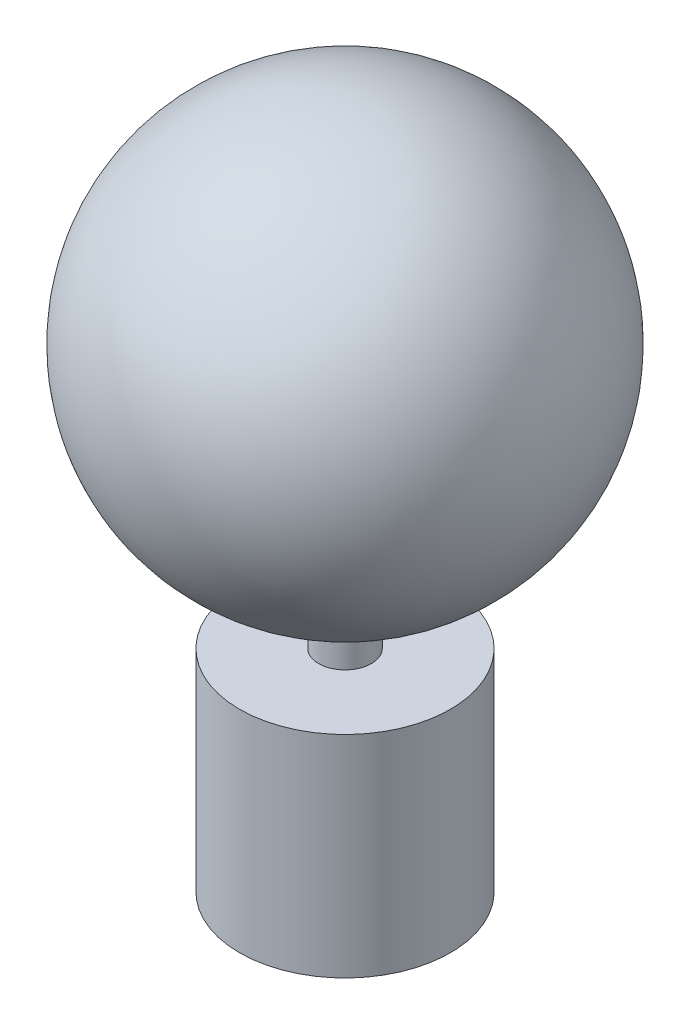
ISO-10303-21;
HEADER;
FILE_DESCRIPTION(('STEP AP214'),'2;1');
FILE_NAME('part.step','',(''),(''),'','','');
FILE_SCHEMA(('AUTOMOTIVE_DESIGN { 1 0 10303 214 1 1 1 1 }'));
ENDSEC;
DATA;
#1=APPLICATION_CONTEXT('core data for automotive mechanical design processes');
#2=APPLICATION_PROTOCOL_DEFINITION('international standard','automotive_design',2000,#1);
#3=PRODUCT_CONTEXT('',#1,'mechanical');
#4=PRODUCT('Part','Part','',(#3));
#5=PRODUCT_RELATED_PRODUCT_CATEGORY('part','',(#4));
#6=PRODUCT_DEFINITION_FORMATION('','',#4);
#7=PRODUCT_DEFINITION_CONTEXT('part definition',#1,'design');
#8=PRODUCT_DEFINITION('design','',#6,#7);
#9=PRODUCT_DEFINITION_SHAPE('','',#8);
#10=(LENGTH_UNIT() NAMED_UNIT(*) SI_UNIT(.MILLI.,.METRE.));
#11=(NAMED_UNIT(*) PLANE_ANGLE_UNIT() SI_UNIT($,.RADIAN.));
#12=(NAMED_UNIT(*) SI_UNIT($,.STERADIAN.) SOLID_ANGLE_UNIT());
#13=UNCERTAINTY_MEASURE_WITH_UNIT(LENGTH_MEASURE(1.E-05),#10,'distance_accuracy_value','');
#14=(GEOMETRIC_REPRESENTATION_CONTEXT(3) GLOBAL_UNCERTAINTY_ASSIGNED_CONTEXT((#13)) GLOBAL_UNIT_ASSIGNED_CONTEXT((#10,
#11,#12)) REPRESENTATION_CONTEXT('',''));
#15=CARTESIAN_POINT('',(0.,0.,0.));
#16=DIRECTION('',(0.,0.,1.));
#17=DIRECTION('',(1.,0.,0.));
#18=AXIS2_PLACEMENT_3D('',#15,#16,#17);
#19=CARTESIAN_POINT('',(0.,31.75,0.));
#20=DIRECTION('',(0.,0.,-1.));
#21=DIRECTION('',(1.,0.,0.));
#22=AXIS2_PLACEMENT_3D('',#19,#20,#21);
#23=SPHERICAL_SURFACE('',#22,25.4);
#24=CARTESIAN_POINT('',(0.,31.75,-25.4));
#25=VERTEX_POINT('',#24);
#26=VERTEX_LOOP('',#25);
#27=FACE_BOUND('',#26,.T.);
#28=ADVANCED_FACE('F39',(#27),#23,.T.);
#29=CLOSED_SHELL('',(#28));
#30=MANIFOLD_SOLID_BREP('B2',#29);
#31=CARTESIAN_POINT('',(0.,-25.4,0.));
#32=DIRECTION('',(0.,1.,0.));
#33=DIRECTION('',(0.,0.,1.));
#34=AXIS2_PLACEMENT_3D('',#31,#32,#33);
#35=CYLINDRICAL_SURFACE('',#34,12.7);
#36=CARTESIAN_POINT('',(0.,-25.4,0.));
#37=DIRECTION('',(0.,1.,0.));
#38=DIRECTION('',(0.,0.,1.));
#39=AXIS2_PLACEMENT_3D('',#36,#37,#38);
#40=CIRCLE('',#39,12.7);
#41=CARTESIAN_POINT('',(0.,-25.4,12.7));
#42=VERTEX_POINT('',#41);
#43=EDGE_CURVE('E37',#42,#42,#40,.T.);
#44=ORIENTED_EDGE('',*,*,#43,.T.);
#45=EDGE_LOOP('',(#44));
#46=FACE_BOUND('',#45,.T.);
#47=CARTESIAN_POINT('',(0.,0.,0.));
#48=DIRECTION('',(0.,1.,0.));
#49=DIRECTION('',(0.,0.,1.));
#50=AXIS2_PLACEMENT_3D('',#47,#48,#49);
#51=CIRCLE('',#50,12.7);
#52=CARTESIAN_POINT('',(0.,0.,12.7));
#53=VERTEX_POINT('',#52);
#54=EDGE_CURVE('E55',#53,#53,#51,.T.);
#55=ORIENTED_EDGE('',*,*,#54,.F.);
#56=EDGE_LOOP('',(#55));
#57=FACE_BOUND('',#56,.T.);
#58=ADVANCED_FACE('F52',(#46,#57),#35,.T.);
#59=CARTESIAN_POINT('',(0.,-25.4,0.));
#60=DIRECTION('',(0.,1.,0.));
#61=DIRECTION('',(0.,0.,1.));
#62=AXIS2_PLACEMENT_3D('',#59,#60,#61);
#63=PLANE('',#62);
#64=ORIENTED_EDGE('',*,*,#43,.F.);
#65=EDGE_LOOP('',(#64));
#66=FACE_BOUND('',#65,.T.);
#67=ADVANCED_FACE('F81',(#66),#63,.F.);
#68=CARTESIAN_POINT('',(0.,0.,0.));
#69=DIRECTION('',(0.,1.,0.));
#70=DIRECTION('',(0.,0.,1.));
#71=AXIS2_PLACEMENT_3D('',#68,#69,#70);
#72=PLANE('',#71);
#73=CARTESIAN_POINT('',(0.,0.,0.));
#74=DIRECTION('',(0.,1.,0.));
#75=DIRECTION('',(0.,0.,1.));
#76=AXIS2_PLACEMENT_3D('',#73,#74,#75);
#77=CIRCLE('',#76,3.175);
#78=CARTESIAN_POINT('',(0.,0.,3.175));
#79=VERTEX_POINT('',#78);
#80=EDGE_CURVE('E70',#79,#79,#77,.T.);
#81=ORIENTED_EDGE('',*,*,#80,.F.);
#82=EDGE_LOOP('',(#81));
#83=FACE_BOUND('',#82,.T.);
#84=ORIENTED_EDGE('',*,*,#54,.T.);
#85=EDGE_LOOP('',(#84));
#86=FACE_BOUND('',#85,.T.);
#87=ADVANCED_FACE('F78',(#83,#86),#72,.T.);
#88=CARTESIAN_POINT('',(0.,6.35,0.));
#89=DIRECTION('',(0.,-1.,0.));
#90=DIRECTION('',(0.,0.,-1.));
#91=AXIS2_PLACEMENT_3D('',#88,#89,#90);
#92=CYLINDRICAL_SURFACE('',#91,3.175);
#93=CARTESIAN_POINT('',(0.,6.35,0.));
#94=DIRECTION('',(0.,1.,0.));
#95=DIRECTION('',(0.,0.,1.));
#96=AXIS2_PLACEMENT_3D('',#93,#94,#95);
#97=CIRCLE('',#96,3.175);
#98=CARTESIAN_POINT('',(0.,6.35,3.175));
#99=VERTEX_POINT('',#98);
#100=EDGE_CURVE('E68',#99,#99,#97,.T.);
#101=ORIENTED_EDGE('',*,*,#100,.F.);
#102=EDGE_LOOP('',(#101));
#103=FACE_BOUND('',#102,.T.);
#104=ORIENTED_EDGE('',*,*,#80,.T.);
#105=EDGE_LOOP('',(#104));
#106=FACE_BOUND('',#105,.T.);
#107=ADVANCED_FACE('F64',(#103,#106),#92,.T.);
#108=CARTESIAN_POINT('',(0.,6.35,0.));
#109=DIRECTION('',(0.,1.,0.));
#110=DIRECTION('',(0.,0.,1.));
#111=AXIS2_PLACEMENT_3D('',#108,#109,#110);
#112=PLANE('',#111);
#113=CARTESIAN_POINT('',(0.,6.35,0.));
#114=VERTEX_POINT('',#113);
#115=VERTEX_LOOP('',#114);
#116=FACE_BOUND('',#115,.T.);
#117=ORIENTED_EDGE('',*,*,#100,.T.);
#118=EDGE_LOOP('',(#117));
#119=FACE_BOUND('',#118,.T.);
#120=ADVANCED_FACE('F61',(#116,#119),#112,.T.);
#121=CLOSED_SHELL('',(#58,#67,#87,#107,#120));
#122=MANIFOLD_SOLID_BREP('B6',#121);
#123=ADVANCED_BREP_SHAPE_REPRESENTATION('',(#18,#30,#122),#14);
#124=SHAPE_DEFINITION_REPRESENTATION(#9,#123);
ENDSEC;
END-ISO-10303-21;
